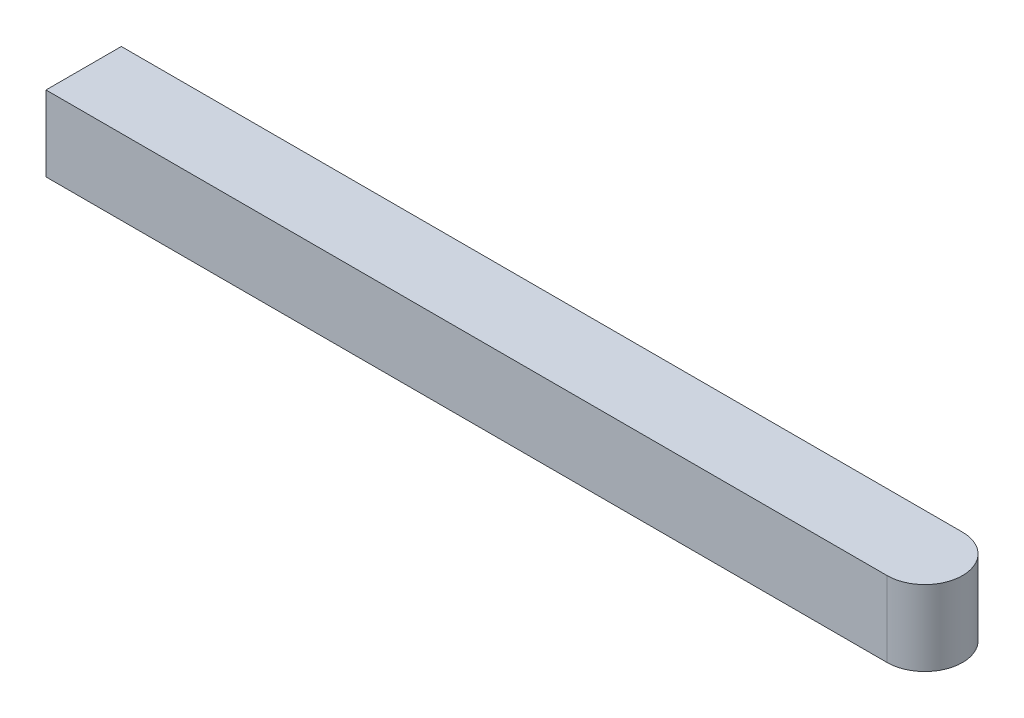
from build123d import *

# Parameters (mm, degrees)
EXTRUSION1_DEPTH = 3


with BuildPart() as part:
    # Esquisse1 → Extrusion1 (new, symmetric)
    with BuildSketch(Plane(origin=(0, 0, 0), x_dir=(1, 0, 0), z_dir=(0, 1, 0))):
        with BuildLine():
            Line((0, 3), (0, -3))
            Line((0, -3), (67, -3))
            ThreePointArc((67, -3), (70, 0), (67, 3))
            Line((67, 3), (0, 3))
        make_face()
    extrude(amount=EXTRUSION1_DEPTH, both=True)


solid = part.part
